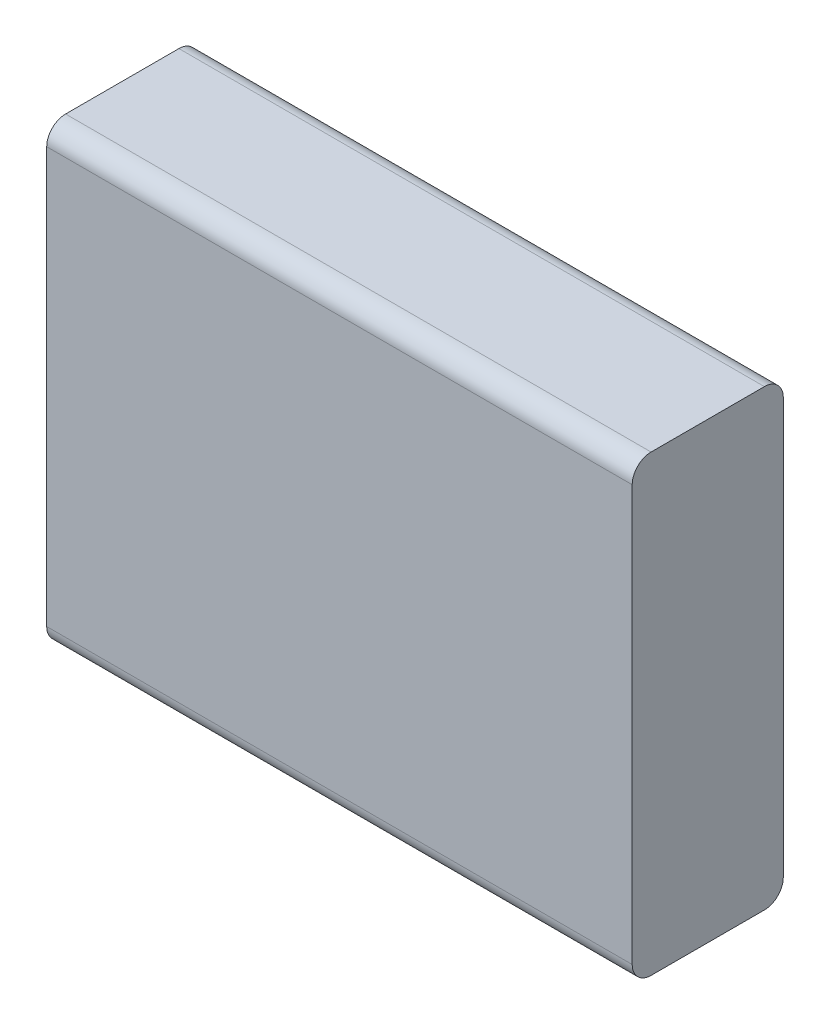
ISO-10303-21;
HEADER;
FILE_DESCRIPTION(('STEP AP214'),'2;1');
FILE_NAME('part.step','',(''),(''),'','','');
FILE_SCHEMA(('AUTOMOTIVE_DESIGN { 1 0 10303 214 1 1 1 1 }'));
ENDSEC;
DATA;
#1=APPLICATION_CONTEXT('core data for automotive mechanical design processes');
#2=APPLICATION_PROTOCOL_DEFINITION('international standard','automotive_design',2000,#1);
#3=PRODUCT_CONTEXT('',#1,'mechanical');
#4=PRODUCT('Part','Part','',(#3));
#5=PRODUCT_RELATED_PRODUCT_CATEGORY('part','',(#4));
#6=PRODUCT_DEFINITION_FORMATION('','',#4);
#7=PRODUCT_DEFINITION_CONTEXT('part definition',#1,'design');
#8=PRODUCT_DEFINITION('design','',#6,#7);
#9=PRODUCT_DEFINITION_SHAPE('','',#8);
#10=(LENGTH_UNIT() NAMED_UNIT(*) SI_UNIT(.MILLI.,.METRE.));
#11=(NAMED_UNIT(*) PLANE_ANGLE_UNIT() SI_UNIT($,.RADIAN.));
#12=(NAMED_UNIT(*) SI_UNIT($,.STERADIAN.) SOLID_ANGLE_UNIT());
#13=UNCERTAINTY_MEASURE_WITH_UNIT(LENGTH_MEASURE(1.E-05),#10,'distance_accuracy_value','');
#14=(GEOMETRIC_REPRESENTATION_CONTEXT(3) GLOBAL_UNCERTAINTY_ASSIGNED_CONTEXT((#13)) GLOBAL_UNIT_ASSIGNED_CONTEXT((#10,
#11,#12)) REPRESENTATION_CONTEXT('',''));
#15=CARTESIAN_POINT('',(0.,0.,0.));
#16=DIRECTION('',(0.,0.,1.));
#17=DIRECTION('',(1.,0.,0.));
#18=AXIS2_PLACEMENT_3D('',#15,#16,#17);
#19=CARTESIAN_POINT('',(0.,0.,2.));
#20=DIRECTION('',(0.,0.,1.));
#21=DIRECTION('',(1.,0.,0.));
#22=AXIS2_PLACEMENT_3D('',#19,#20,#21);
#23=PLANE('',#22);
#24=DIRECTION('',(0.,1.,0.));
#25=VECTOR('',#24,1.);
#26=CARTESIAN_POINT('',(55.,39.,2.));
#27=LINE('',#26,#25);
#28=CARTESIAN_POINT('',(55.,31.,2.));
#29=VERTEX_POINT('',#28);
#30=CARTESIAN_POINT('',(55.,39.,2.));
#31=VERTEX_POINT('',#30);
#32=EDGE_CURVE('E187',#29,#31,#27,.T.);
#33=ORIENTED_EDGE('',*,*,#32,.T.);
#34=DIRECTION('',(1.,0.,0.));
#35=VECTOR('',#34,1.);
#36=CARTESIAN_POINT('',(55.,39.,2.));
#37=LINE('',#36,#35);
#38=CARTESIAN_POINT('',(59.,39.,2.));
#39=VERTEX_POINT('',#38);
#40=EDGE_CURVE('E191',#31,#39,#37,.T.);
#41=ORIENTED_EDGE('',*,*,#40,.T.);
#42=DIRECTION('',(0.,-1.,0.));
#43=VECTOR('',#42,1.);
#44=CARTESIAN_POINT('',(59.,39.,2.));
#45=LINE('',#44,#43);
#46=CARTESIAN_POINT('',(59.,31.,2.));
#47=VERTEX_POINT('',#46);
#48=EDGE_CURVE('E196',#39,#47,#45,.T.);
#49=ORIENTED_EDGE('',*,*,#48,.T.);
#50=DIRECTION('',(-1.,0.,0.));
#51=VECTOR('',#50,1.);
#52=CARTESIAN_POINT('',(55.,31.,2.));
#53=LINE('',#52,#51);
#54=EDGE_CURVE('E200',#47,#29,#53,.T.);
#55=ORIENTED_EDGE('',*,*,#54,.T.);
#56=EDGE_LOOP('',(#33,#41,#49,#55));
#57=FACE_BOUND('',#56,.T.);
#58=DIRECTION('',(0.,-1.,0.));
#59=VECTOR('',#58,1.);
#60=CARTESIAN_POINT('',(58.7,38.7,2.));
#61=LINE('',#60,#59);
#62=CARTESIAN_POINT('',(58.7,38.7,2.));
#63=VERTEX_POINT('',#62);
#64=CARTESIAN_POINT('',(58.7,35.3,2.));
#65=VERTEX_POINT('',#64);
#66=EDGE_CURVE('E175',#63,#65,#61,.T.);
#67=ORIENTED_EDGE('',*,*,#66,.F.);
#68=DIRECTION('',(1.,0.,0.));
#69=VECTOR('',#68,1.);
#70=CARTESIAN_POINT('',(58.7,38.7,2.));
#71=LINE('',#70,#69);
#72=CARTESIAN_POINT('',(55.3,38.7,2.));
#73=VERTEX_POINT('',#72);
#74=EDGE_CURVE('E172',#73,#63,#71,.T.);
#75=ORIENTED_EDGE('',*,*,#74,.F.);
#76=DIRECTION('',(0.,1.,0.));
#77=VECTOR('',#76,1.);
#78=CARTESIAN_POINT('',(55.3,38.7,2.));
#79=LINE('',#78,#77);
#80=CARTESIAN_POINT('',(55.3,35.3,2.));
#81=VERTEX_POINT('',#80);
#82=EDGE_CURVE('E60',#81,#73,#79,.T.);
#83=ORIENTED_EDGE('',*,*,#82,.F.);
#84=DIRECTION('',(-1.,0.,0.));
#85=VECTOR('',#84,1.);
#86=CARTESIAN_POINT('',(58.7,35.3,2.));
#87=LINE('',#86,#85);
#88=EDGE_CURVE('E55',#65,#81,#87,.T.);
#89=ORIENTED_EDGE('',*,*,#88,.F.);
#90=EDGE_LOOP('',(#67,#75,#83,#89));
#91=FACE_BOUND('',#90,.T.);
#92=ADVANCED_FACE('F39',(#57,#91),#23,.F.);
#93=CARTESIAN_POINT('',(0.,0.,16.));
#94=DIRECTION('',(1.,0.,0.));
#95=DIRECTION('',(0.,0.,-1.));
#96=AXIS2_PLACEMENT_3D('',#93,#94,#95);
#97=PLANE('',#96);
#98=DIRECTION('',(0.,-1.,0.));
#99=VECTOR('',#98,1.);
#100=CARTESIAN_POINT('',(0.,0.,0.));
#101=LINE('',#100,#99);
#102=CARTESIAN_POINT('',(0.,46.,0.));
#103=VERTEX_POINT('',#102);
#104=CARTESIAN_POINT('',(0.,2.,0.));
#105=VERTEX_POINT('',#104);
#106=EDGE_CURVE('E218',#103,#105,#101,.T.);
#107=ORIENTED_EDGE('',*,*,#106,.T.);
#108=CARTESIAN_POINT('',(0.,2.,2.));
#109=DIRECTION('',(1.,0.,0.));
#110=DIRECTION('',(0.,0.,-1.));
#111=AXIS2_PLACEMENT_3D('',#108,#109,#110);
#112=CIRCLE('',#111,2.);
#113=CARTESIAN_POINT('',(0.,0.,2.));
#114=VERTEX_POINT('',#113);
#115=EDGE_CURVE('E293',#105,#114,#112,.F.);
#116=ORIENTED_EDGE('',*,*,#115,.T.);
#117=DIRECTION('',(0.,0.,-1.));
#118=VECTOR('',#117,1.);
#119=CARTESIAN_POINT('',(0.,0.,16.));
#120=LINE('',#119,#118);
#121=CARTESIAN_POINT('',(0.,0.,14.));
#122=VERTEX_POINT('',#121);
#123=EDGE_CURVE('E255',#122,#114,#120,.T.);
#124=ORIENTED_EDGE('',*,*,#123,.F.);
#125=CARTESIAN_POINT('',(0.,2.,14.));
#126=DIRECTION('',(1.,0.,0.));
#127=DIRECTION('',(0.,0.,-1.));
#128=AXIS2_PLACEMENT_3D('',#125,#126,#127);
#129=CIRCLE('',#128,2.);
#130=CARTESIAN_POINT('',(0.,2.,16.));
#131=VERTEX_POINT('',#130);
#132=EDGE_CURVE('E290',#122,#131,#129,.F.);
#133=ORIENTED_EDGE('',*,*,#132,.T.);
#134=DIRECTION('',(0.,-1.,0.));
#135=VECTOR('',#134,1.);
#136=CARTESIAN_POINT('',(0.,0.,16.));
#137=LINE('',#136,#135);
#138=CARTESIAN_POINT('',(0.,46.,16.));
#139=VERTEX_POINT('',#138);
#140=EDGE_CURVE('E228',#139,#131,#137,.T.);
#141=ORIENTED_EDGE('',*,*,#140,.F.);
#142=CARTESIAN_POINT('',(0.,46.,14.));
#143=DIRECTION('',(1.,0.,0.));
#144=DIRECTION('',(0.,0.,-1.));
#145=AXIS2_PLACEMENT_3D('',#142,#143,#144);
#146=CIRCLE('',#145,2.);
#147=CARTESIAN_POINT('',(0.,48.,14.));
#148=VERTEX_POINT('',#147);
#149=EDGE_CURVE('E284',#139,#148,#146,.F.);
#150=ORIENTED_EDGE('',*,*,#149,.T.);
#151=DIRECTION('',(0.,0.,-1.));
#152=VECTOR('',#151,1.);
#153=CARTESIAN_POINT('',(0.,48.,16.));
#154=LINE('',#153,#152);
#155=CARTESIAN_POINT('',(0.,48.,2.));
#156=VERTEX_POINT('',#155);
#157=EDGE_CURVE('E237',#148,#156,#154,.T.);
#158=ORIENTED_EDGE('',*,*,#157,.T.);
#159=CARTESIAN_POINT('',(0.,46.,2.));
#160=DIRECTION('',(1.,0.,0.));
#161=DIRECTION('',(0.,0.,-1.));
#162=AXIS2_PLACEMENT_3D('',#159,#160,#161);
#163=CIRCLE('',#162,2.);
#164=EDGE_CURVE('E287',#156,#103,#163,.F.);
#165=ORIENTED_EDGE('',*,*,#164,.T.);
#166=EDGE_LOOP('',(#107,#116,#124,#133,#141,#150,#158,#165));
#167=FACE_BOUND('',#166,.T.);
#168=ADVANCED_FACE('F322',(#167),#97,.F.);
#169=CARTESIAN_POINT('',(0.,0.,16.));
#170=DIRECTION('',(0.,1.,0.));
#171=DIRECTION('',(0.,0.,1.));
#172=AXIS2_PLACEMENT_3D('',#169,#170,#171);
#173=PLANE('',#172);
#174=ORIENTED_EDGE('',*,*,#123,.T.);
#175=DIRECTION('',(1.,0.,0.));
#176=VECTOR('',#175,1.);
#177=CARTESIAN_POINT('',(62.,0.,2.));
#178=LINE('',#177,#176);
#179=CARTESIAN_POINT('',(62.,0.,2.));
#180=VERTEX_POINT('',#179);
#181=EDGE_CURVE('E262',#114,#180,#178,.T.);
#182=ORIENTED_EDGE('',*,*,#181,.T.);
#183=DIRECTION('',(0.,0.,-1.));
#184=VECTOR('',#183,1.);
#185=CARTESIAN_POINT('',(62.,0.,16.));
#186=LINE('',#185,#184);
#187=CARTESIAN_POINT('',(62.,0.,14.));
#188=VERTEX_POINT('',#187);
#189=EDGE_CURVE('E251',#188,#180,#186,.T.);
#190=ORIENTED_EDGE('',*,*,#189,.F.);
#191=DIRECTION('',(1.,0.,0.));
#192=VECTOR('',#191,1.);
#193=CARTESIAN_POINT('',(0.,0.,14.));
#194=LINE('',#193,#192);
#195=EDGE_CURVE('E259',#188,#122,#194,.F.);
#196=ORIENTED_EDGE('',*,*,#195,.T.);
#197=EDGE_LOOP('',(#174,#182,#190,#196));
#198=FACE_BOUND('',#197,.T.);
#199=ADVANCED_FACE('F330',(#198),#173,.F.);
#200=CARTESIAN_POINT('',(62.,0.,16.));
#201=DIRECTION('',(-1.,0.,0.));
#202=DIRECTION('',(0.,0.,1.));
#203=AXIS2_PLACEMENT_3D('',#200,#201,#202);
#204=PLANE('',#203);
#205=ORIENTED_EDGE('',*,*,#189,.T.);
#206=CARTESIAN_POINT('',(62.,2.,2.));
#207=DIRECTION('',(-1.,0.,0.));
#208=DIRECTION('',(0.,0.,1.));
#209=AXIS2_PLACEMENT_3D('',#206,#207,#208);
#210=CIRCLE('',#209,2.);
#211=CARTESIAN_POINT('',(62.,2.,0.));
#212=VERTEX_POINT('',#211);
#213=EDGE_CURVE('E275',#180,#212,#210,.F.);
#214=ORIENTED_EDGE('',*,*,#213,.T.);
#215=DIRECTION('',(0.,1.,0.));
#216=VECTOR('',#215,1.);
#217=CARTESIAN_POINT('',(62.,0.,0.));
#218=LINE('',#217,#216);
#219=CARTESIAN_POINT('',(62.,46.,0.));
#220=VERTEX_POINT('',#219);
#221=EDGE_CURVE('E233',#212,#220,#218,.T.);
#222=ORIENTED_EDGE('',*,*,#221,.T.);
#223=CARTESIAN_POINT('',(62.,46.,2.));
#224=DIRECTION('',(-1.,0.,0.));
#225=DIRECTION('',(0.,0.,1.));
#226=AXIS2_PLACEMENT_3D('',#223,#224,#225);
#227=CIRCLE('',#226,2.);
#228=CARTESIAN_POINT('',(62.,48.,2.));
#229=VERTEX_POINT('',#228);
#230=EDGE_CURVE('E269',#220,#229,#227,.F.);
#231=ORIENTED_EDGE('',*,*,#230,.T.);
#232=DIRECTION('',(0.,0.,-1.));
#233=VECTOR('',#232,1.);
#234=CARTESIAN_POINT('',(62.,48.,16.));
#235=LINE('',#234,#233);
#236=CARTESIAN_POINT('',(62.,48.,14.));
#237=VERTEX_POINT('',#236);
#238=EDGE_CURVE('E247',#237,#229,#235,.T.);
#239=ORIENTED_EDGE('',*,*,#238,.F.);
#240=CARTESIAN_POINT('',(62.,46.,14.));
#241=DIRECTION('',(-1.,0.,0.));
#242=DIRECTION('',(0.,0.,1.));
#243=AXIS2_PLACEMENT_3D('',#240,#241,#242);
#244=CIRCLE('',#243,2.);
#245=CARTESIAN_POINT('',(62.,46.,16.));
#246=VERTEX_POINT('',#245);
#247=EDGE_CURVE('E266',#237,#246,#244,.F.);
#248=ORIENTED_EDGE('',*,*,#247,.T.);
#249=DIRECTION('',(0.,1.,0.));
#250=VECTOR('',#249,1.);
#251=CARTESIAN_POINT('',(62.,0.,16.));
#252=LINE('',#251,#250);
#253=CARTESIAN_POINT('',(62.,2.,16.));
#254=VERTEX_POINT('',#253);
#255=EDGE_CURVE('E232',#254,#246,#252,.T.);
#256=ORIENTED_EDGE('',*,*,#255,.F.);
#257=CARTESIAN_POINT('',(62.,2.,14.));
#258=DIRECTION('',(-1.,0.,0.));
#259=DIRECTION('',(0.,0.,1.));
#260=AXIS2_PLACEMENT_3D('',#257,#258,#259);
#261=CIRCLE('',#260,2.);
#262=EDGE_CURVE('E272',#254,#188,#261,.F.);
#263=ORIENTED_EDGE('',*,*,#262,.T.);
#264=EDGE_LOOP('',(#205,#214,#222,#231,#239,#248,#256,#263));
#265=FACE_BOUND('',#264,.T.);
#266=ADVANCED_FACE('F313',(#265),#204,.F.);
#267=CARTESIAN_POINT('',(0.,48.,16.));
#268=DIRECTION('',(0.,-1.,0.));
#269=DIRECTION('',(0.,0.,-1.));
#270=AXIS2_PLACEMENT_3D('',#267,#268,#269);
#271=PLANE('',#270);
#272=ORIENTED_EDGE('',*,*,#238,.T.);
#273=DIRECTION('',(-1.,0.,0.));
#274=VECTOR('',#273,1.);
#275=CARTESIAN_POINT('',(0.,48.,2.));
#276=LINE('',#275,#274);
#277=EDGE_CURVE('E11',#229,#156,#276,.T.);
#278=ORIENTED_EDGE('',*,*,#277,.T.);
#279=ORIENTED_EDGE('',*,*,#157,.F.);
#280=DIRECTION('',(-1.,0.,0.));
#281=VECTOR('',#280,1.);
#282=CARTESIAN_POINT('',(0.,48.,14.));
#283=LINE('',#282,#281);
#284=EDGE_CURVE('E48',#148,#237,#283,.F.);
#285=ORIENTED_EDGE('',*,*,#284,.T.);
#286=EDGE_LOOP('',(#272,#278,#279,#285));
#287=FACE_BOUND('',#286,.T.);
#288=ADVANCED_FACE('F308',(#287),#271,.F.);
#289=CARTESIAN_POINT('',(0.,0.,16.));
#290=DIRECTION('',(0.,0.,-1.));
#291=DIRECTION('',(-1.,0.,0.));
#292=AXIS2_PLACEMENT_3D('',#289,#290,#291);
#293=PLANE('',#292);
#294=ORIENTED_EDGE('',*,*,#140,.T.);
#295=DIRECTION('',(1.,0.,0.));
#296=VECTOR('',#295,1.);
#297=CARTESIAN_POINT('',(0.,2.,16.));
#298=LINE('',#297,#296);
#299=EDGE_CURVE('E300',#131,#254,#298,.T.);
#300=ORIENTED_EDGE('',*,*,#299,.T.);
#301=ORIENTED_EDGE('',*,*,#255,.T.);
#302=DIRECTION('',(-1.,0.,0.));
#303=VECTOR('',#302,1.);
#304=CARTESIAN_POINT('',(0.,46.,16.));
#305=LINE('',#304,#303);
#306=EDGE_CURVE('E296',#246,#139,#305,.T.);
#307=ORIENTED_EDGE('',*,*,#306,.T.);
#308=EDGE_LOOP('',(#294,#300,#301,#307));
#309=FACE_BOUND('',#308,.T.);
#310=ADVANCED_FACE('F319',(#309),#293,.F.);
#311=CARTESIAN_POINT('',(0.,0.,0.));
#312=DIRECTION('',(0.,0.,-1.));
#313=DIRECTION('',(-1.,0.,0.));
#314=AXIS2_PLACEMENT_3D('',#311,#312,#313);
#315=PLANE('',#314);
#316=DIRECTION('',(0.,1.,0.));
#317=VECTOR('',#316,1.);
#318=CARTESIAN_POINT('',(55.,39.,0.));
#319=LINE('',#318,#317);
#320=CARTESIAN_POINT('',(55.,31.,0.));
#321=VERTEX_POINT('',#320);
#322=CARTESIAN_POINT('',(55.,39.,0.));
#323=VERTEX_POINT('',#322);
#324=EDGE_CURVE('E177',#321,#323,#319,.T.);
#325=ORIENTED_EDGE('',*,*,#324,.F.);
#326=DIRECTION('',(-1.,0.,0.));
#327=VECTOR('',#326,1.);
#328=CARTESIAN_POINT('',(55.,31.,0.));
#329=LINE('',#328,#327);
#330=CARTESIAN_POINT('',(59.,31.,0.));
#331=VERTEX_POINT('',#330);
#332=EDGE_CURVE('E192',#331,#321,#329,.T.);
#333=ORIENTED_EDGE('',*,*,#332,.F.);
#334=DIRECTION('',(0.,-1.,0.));
#335=VECTOR('',#334,1.);
#336=CARTESIAN_POINT('',(59.,39.,0.));
#337=LINE('',#336,#335);
#338=CARTESIAN_POINT('',(59.,39.,0.));
#339=VERTEX_POINT('',#338);
#340=EDGE_CURVE('E208',#339,#331,#337,.T.);
#341=ORIENTED_EDGE('',*,*,#340,.F.);
#342=DIRECTION('',(1.,0.,0.));
#343=VECTOR('',#342,1.);
#344=CARTESIAN_POINT('',(55.,39.,0.));
#345=LINE('',#344,#343);
#346=EDGE_CURVE('E181',#323,#339,#345,.T.);
#347=ORIENTED_EDGE('',*,*,#346,.F.);
#348=EDGE_LOOP('',(#325,#333,#341,#347));
#349=FACE_BOUND('',#348,.T.);
#350=ORIENTED_EDGE('',*,*,#221,.F.);
#351=DIRECTION('',(1.,0.,0.));
#352=VECTOR('',#351,1.);
#353=CARTESIAN_POINT('',(0.,2.,0.));
#354=LINE('',#353,#352);
#355=EDGE_CURVE('E281',#212,#105,#354,.F.);
#356=ORIENTED_EDGE('',*,*,#355,.T.);
#357=ORIENTED_EDGE('',*,*,#106,.F.);
#358=DIRECTION('',(-1.,0.,0.));
#359=VECTOR('',#358,1.);
#360=CARTESIAN_POINT('',(62.,46.,0.));
#361=LINE('',#360,#359);
#362=EDGE_CURVE('E278',#103,#220,#361,.F.);
#363=ORIENTED_EDGE('',*,*,#362,.T.);
#364=EDGE_LOOP('',(#350,#356,#357,#363));
#365=FACE_BOUND('',#364,.T.);
#366=ADVANCED_FACE('F338',(#349,#365),#315,.T.);
#367=CARTESIAN_POINT('',(0.,2.,2.));
#368=DIRECTION('',(-1.,0.,0.));
#369=DIRECTION('',(0.,0.,1.));
#370=AXIS2_PLACEMENT_3D('',#367,#368,#369);
#371=CYLINDRICAL_SURFACE('',#370,2.);
#372=ORIENTED_EDGE('',*,*,#115,.F.);
#373=ORIENTED_EDGE('',*,*,#355,.F.);
#374=ORIENTED_EDGE('',*,*,#213,.F.);
#375=ORIENTED_EDGE('',*,*,#181,.F.);
#376=EDGE_LOOP('',(#372,#373,#374,#375));
#377=FACE_BOUND('',#376,.T.);
#378=ADVANCED_FACE('F334',(#377),#371,.T.);
#379=CARTESIAN_POINT('',(0.,2.,14.));
#380=DIRECTION('',(1.,0.,0.));
#381=DIRECTION('',(0.,0.,-1.));
#382=AXIS2_PLACEMENT_3D('',#379,#380,#381);
#383=CYLINDRICAL_SURFACE('',#382,2.);
#384=ORIENTED_EDGE('',*,*,#132,.F.);
#385=ORIENTED_EDGE('',*,*,#195,.F.);
#386=ORIENTED_EDGE('',*,*,#262,.F.);
#387=ORIENTED_EDGE('',*,*,#299,.F.);
#388=EDGE_LOOP('',(#384,#385,#386,#387));
#389=FACE_BOUND('',#388,.T.);
#390=ADVANCED_FACE('F327',(#389),#383,.T.);
#391=CARTESIAN_POINT('',(0.,46.,2.));
#392=DIRECTION('',(1.,0.,0.));
#393=DIRECTION('',(0.,0.,-1.));
#394=AXIS2_PLACEMENT_3D('',#391,#392,#393);
#395=CYLINDRICAL_SURFACE('',#394,2.);
#396=ORIENTED_EDGE('',*,*,#230,.F.);
#397=ORIENTED_EDGE('',*,*,#362,.F.);
#398=ORIENTED_EDGE('',*,*,#164,.F.);
#399=ORIENTED_EDGE('',*,*,#277,.F.);
#400=EDGE_LOOP('',(#396,#397,#398,#399));
#401=FACE_BOUND('',#400,.T.);
#402=ADVANCED_FACE('F342',(#401),#395,.T.);
#403=CARTESIAN_POINT('',(0.,46.,14.));
#404=DIRECTION('',(-1.,0.,0.));
#405=DIRECTION('',(0.,0.,1.));
#406=AXIS2_PLACEMENT_3D('',#403,#404,#405);
#407=CYLINDRICAL_SURFACE('',#406,2.);
#408=ORIENTED_EDGE('',*,*,#247,.F.);
#409=ORIENTED_EDGE('',*,*,#284,.F.);
#410=ORIENTED_EDGE('',*,*,#149,.F.);
#411=ORIENTED_EDGE('',*,*,#306,.F.);
#412=EDGE_LOOP('',(#408,#409,#410,#411));
#413=FACE_BOUND('',#412,.T.);
#414=ADVANCED_FACE('F41',(#413),#407,.T.);
#415=CARTESIAN_POINT('',(55.,39.,2.));
#416=DIRECTION('',(-1.,0.,0.));
#417=DIRECTION('',(0.,0.,1.));
#418=AXIS2_PLACEMENT_3D('',#415,#416,#417);
#419=PLANE('',#418);
#420=ORIENTED_EDGE('',*,*,#324,.T.);
#421=DIRECTION('',(0.,0.,-1.));
#422=VECTOR('',#421,1.);
#423=CARTESIAN_POINT('',(55.,39.,2.));
#424=LINE('',#423,#422);
#425=EDGE_CURVE('E203',#31,#323,#424,.T.);
#426=ORIENTED_EDGE('',*,*,#425,.F.);
#427=ORIENTED_EDGE('',*,*,#32,.F.);
#428=DIRECTION('',(0.,0.,-1.));
#429=VECTOR('',#428,1.);
#430=CARTESIAN_POINT('',(55.,31.,2.));
#431=LINE('',#430,#429);
#432=EDGE_CURVE('E215',#29,#321,#431,.T.);
#433=ORIENTED_EDGE('',*,*,#432,.T.);
#434=EDGE_LOOP('',(#420,#426,#427,#433));
#435=FACE_BOUND('',#434,.T.);
#436=ADVANCED_FACE('F348',(#435),#419,.F.);
#437=CARTESIAN_POINT('',(55.,31.,2.));
#438=DIRECTION('',(0.,-1.,0.));
#439=DIRECTION('',(0.,0.,-1.));
#440=AXIS2_PLACEMENT_3D('',#437,#438,#439);
#441=PLANE('',#440);
#442=ORIENTED_EDGE('',*,*,#332,.T.);
#443=ORIENTED_EDGE('',*,*,#432,.F.);
#444=ORIENTED_EDGE('',*,*,#54,.F.);
#445=DIRECTION('',(0.,0.,-1.));
#446=VECTOR('',#445,1.);
#447=CARTESIAN_POINT('',(59.,31.,2.));
#448=LINE('',#447,#446);
#449=EDGE_CURVE('E219',#47,#331,#448,.T.);
#450=ORIENTED_EDGE('',*,*,#449,.T.);
#451=EDGE_LOOP('',(#442,#443,#444,#450));
#452=FACE_BOUND('',#451,.T.);
#453=ADVANCED_FACE('F362',(#452),#441,.F.);
#454=CARTESIAN_POINT('',(59.,39.,2.));
#455=DIRECTION('',(1.,0.,0.));
#456=DIRECTION('',(0.,1.,0.));
#457=AXIS2_PLACEMENT_3D('',#454,#455,#456);
#458=PLANE('',#457);
#459=ORIENTED_EDGE('',*,*,#340,.T.);
#460=ORIENTED_EDGE('',*,*,#449,.F.);
#461=ORIENTED_EDGE('',*,*,#48,.F.);
#462=DIRECTION('',(0.,0.,-1.));
#463=VECTOR('',#462,1.);
#464=CARTESIAN_POINT('',(59.,39.,2.));
#465=LINE('',#464,#463);
#466=EDGE_CURVE('E222',#39,#339,#465,.T.);
#467=ORIENTED_EDGE('',*,*,#466,.T.);
#468=EDGE_LOOP('',(#459,#460,#461,#467));
#469=FACE_BOUND('',#468,.T.);
#470=ADVANCED_FACE('F365',(#469),#458,.F.);
#471=CARTESIAN_POINT('',(55.,39.,2.));
#472=DIRECTION('',(0.,1.,0.));
#473=DIRECTION('',(-1.,0.,0.));
#474=AXIS2_PLACEMENT_3D('',#471,#472,#473);
#475=PLANE('',#474);
#476=ORIENTED_EDGE('',*,*,#346,.T.);
#477=ORIENTED_EDGE('',*,*,#466,.F.);
#478=ORIENTED_EDGE('',*,*,#40,.F.);
#479=ORIENTED_EDGE('',*,*,#425,.T.);
#480=EDGE_LOOP('',(#476,#477,#478,#479));
#481=FACE_BOUND('',#480,.T.);
#482=ADVANCED_FACE('F369',(#481),#475,.F.);
#483=CARTESIAN_POINT('',(58.7,38.7,-1.5));
#484=DIRECTION('',(-1.,0.,0.));
#485=DIRECTION('',(0.,0.,1.));
#486=AXIS2_PLACEMENT_3D('',#483,#484,#485);
#487=PLANE('',#486);
#488=ORIENTED_EDGE('',*,*,#66,.T.);
#489=DIRECTION('',(0.,0.,1.));
#490=VECTOR('',#489,1.);
#491=CARTESIAN_POINT('',(58.7,35.3,-1.5));
#492=LINE('',#491,#490);
#493=CARTESIAN_POINT('',(58.7,35.3,-1.5));
#494=VERTEX_POINT('',#493);
#495=EDGE_CURVE('E154',#494,#65,#492,.T.);
#496=ORIENTED_EDGE('',*,*,#495,.F.);
#497=DIRECTION('',(0.,-1.,0.));
#498=VECTOR('',#497,1.);
#499=CARTESIAN_POINT('',(58.7,38.7,-1.5));
#500=LINE('',#499,#498);
#501=CARTESIAN_POINT('',(58.7,38.7,-1.5));
#502=VERTEX_POINT('',#501);
#503=EDGE_CURVE('E162',#502,#494,#500,.T.);
#504=ORIENTED_EDGE('',*,*,#503,.F.);
#505=DIRECTION('',(0.,0.,1.));
#506=VECTOR('',#505,1.);
#507=CARTESIAN_POINT('',(58.7,38.7,-1.5));
#508=LINE('',#507,#506);
#509=EDGE_CURVE('E484',#502,#63,#508,.T.);
#510=ORIENTED_EDGE('',*,*,#509,.T.);
#511=EDGE_LOOP('',(#488,#496,#504,#510));
#512=FACE_BOUND('',#511,.T.);
#513=ADVANCED_FACE('F174',(#512),#487,.F.);
#514=CARTESIAN_POINT('',(58.7,35.3,-1.5));
#515=DIRECTION('',(0.,1.,0.));
#516=DIRECTION('',(0.,0.,1.));
#517=AXIS2_PLACEMENT_3D('',#514,#515,#516);
#518=PLANE('',#517);
#519=ORIENTED_EDGE('',*,*,#88,.T.);
#520=DIRECTION('',(0.,0.,1.));
#521=VECTOR('',#520,1.);
#522=CARTESIAN_POINT('',(55.3,35.3,-1.5));
#523=LINE('',#522,#521);
#524=CARTESIAN_POINT('',(55.3,35.3,-1.5));
#525=VERTEX_POINT('',#524);
#526=EDGE_CURVE('E157',#525,#81,#523,.T.);
#527=ORIENTED_EDGE('',*,*,#526,.F.);
#528=DIRECTION('',(-1.,0.,0.));
#529=VECTOR('',#528,1.);
#530=CARTESIAN_POINT('',(58.7,35.3,-1.5));
#531=LINE('',#530,#529);
#532=EDGE_CURVE('E150',#494,#525,#531,.T.);
#533=ORIENTED_EDGE('',*,*,#532,.F.);
#534=ORIENTED_EDGE('',*,*,#495,.T.);
#535=EDGE_LOOP('',(#519,#527,#533,#534));
#536=FACE_BOUND('',#535,.T.);
#537=ADVANCED_FACE('F152',(#536),#518,.F.);
#538=CARTESIAN_POINT('',(55.3,38.7,-1.5));
#539=DIRECTION('',(1.,0.,0.));
#540=DIRECTION('',(0.,0.,-1.));
#541=AXIS2_PLACEMENT_3D('',#538,#539,#540);
#542=PLANE('',#541);
#543=ORIENTED_EDGE('',*,*,#82,.T.);
#544=DIRECTION('',(0.,0.,1.));
#545=VECTOR('',#544,1.);
#546=CARTESIAN_POINT('',(55.3,38.7,-1.5));
#547=LINE('',#546,#545);
#548=CARTESIAN_POINT('',(55.3,38.7,-1.5));
#549=VERTEX_POINT('',#548);
#550=EDGE_CURVE('E183',#549,#73,#547,.T.);
#551=ORIENTED_EDGE('',*,*,#550,.F.);
#552=DIRECTION('',(0.,1.,0.));
#553=VECTOR('',#552,1.);
#554=CARTESIAN_POINT('',(55.3,38.7,-1.5));
#555=LINE('',#554,#553);
#556=EDGE_CURVE('E161',#525,#549,#555,.T.);
#557=ORIENTED_EDGE('',*,*,#556,.F.);
#558=ORIENTED_EDGE('',*,*,#526,.T.);
#559=EDGE_LOOP('',(#543,#551,#557,#558));
#560=FACE_BOUND('',#559,.T.);
#561=ADVANCED_FACE('F452',(#560),#542,.F.);
#562=CARTESIAN_POINT('',(58.7,38.7,-1.5));
#563=DIRECTION('',(0.,-1.,0.));
#564=DIRECTION('',(0.,0.,-1.));
#565=AXIS2_PLACEMENT_3D('',#562,#563,#564);
#566=PLANE('',#565);
#567=ORIENTED_EDGE('',*,*,#74,.T.);
#568=ORIENTED_EDGE('',*,*,#509,.F.);
#569=DIRECTION('',(1.,0.,0.));
#570=VECTOR('',#569,1.);
#571=CARTESIAN_POINT('',(58.7,38.7,-1.5));
#572=LINE('',#571,#570);
#573=EDGE_CURVE('E167',#549,#502,#572,.T.);
#574=ORIENTED_EDGE('',*,*,#573,.F.);
#575=ORIENTED_EDGE('',*,*,#550,.T.);
#576=EDGE_LOOP('',(#567,#568,#574,#575));
#577=FACE_BOUND('',#576,.T.);
#578=ADVANCED_FACE('F460',(#577),#566,.F.);
#579=CARTESIAN_POINT('',(0.,0.,-1.5));
#580=DIRECTION('',(0.,0.,-1.));
#581=DIRECTION('',(-1.,0.,0.));
#582=AXIS2_PLACEMENT_3D('',#579,#580,#581);
#583=PLANE('',#582);
#584=ORIENTED_EDGE('',*,*,#503,.T.);
#585=ORIENTED_EDGE('',*,*,#532,.T.);
#586=ORIENTED_EDGE('',*,*,#556,.T.);
#587=ORIENTED_EDGE('',*,*,#573,.T.);
#588=EDGE_LOOP('',(#584,#585,#586,#587));
#589=FACE_BOUND('',#588,.T.);
#590=ADVANCED_FACE('F165',(#589),#583,.T.);
#591=CLOSED_SHELL('',(#92,#168,#199,#266,#288,#310,#366,#378,#390,#402,#414,#436,#453,#470,#482,
#513,#537,#561,#578,#590));
#592=MANIFOLD_SOLID_BREP('B2',#591);
#593=ADVANCED_BREP_SHAPE_REPRESENTATION('',(#18,#592),#14);
#594=SHAPE_DEFINITION_REPRESENTATION(#9,#593);
ENDSEC;
END-ISO-10303-21;
